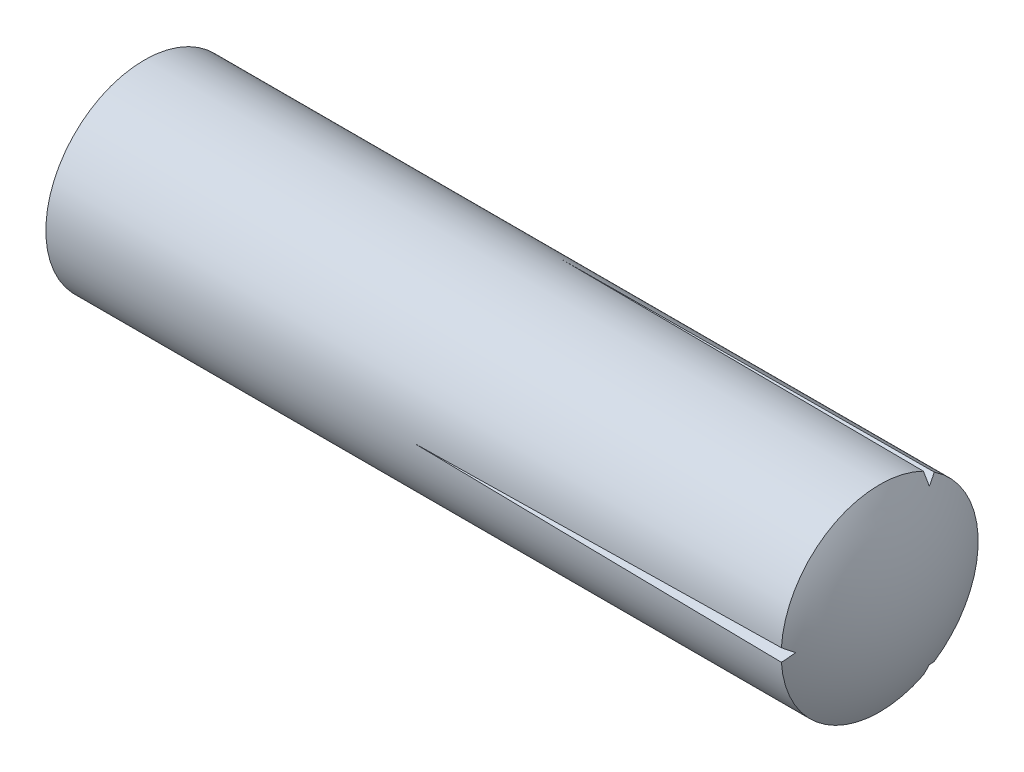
from build123d import *

# Parameters (mm, degrees)
CIRPATTERN1_COUNT = 3


with BuildPart() as part:
    # Sketch1 → Base-Revolve (revolve)
    with BuildSketch(Plane.XY):
        with BuildLine():
            Line((-100, 0), (-100, 1.25))
            ThreePointArc((-100, 1.25), (-99.010050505, 7.072345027), (-96.68190465, 12.5))
            Line((-96.68190465, 12.5), (-3.349364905, 12.5))
            ThreePointArc((-3.349364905, 12.5), (-0.851854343, 6.470476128), (0, 0))
            Line((0, 0), (-100, 0))
        make_face()
    revolve(axis=Axis((-40, 0, 0), (1, 0, 0)))

    # Cut-Sweep1: sweep along a path in Sketch4
    with BuildLine(Plane(origin=(0, 0, 0), x_dir=(1, 0, 0), z_dir=(0, 1, 0))) as cut_sweep1_path:
        Line((0, -11.25), (-50, -12.5))
    # Sketch2 → Cut-Sweep1 (sweep, cut)
    with BuildSketch(Plane(origin=(0, 0, 0), x_dir=(0, 0, -1), z_dir=(1, 0, 0))):
        Polygon((-11.25, 0), (-12.5, 0.875259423), (-12.5, -0.875259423), align=None)
    cut_sweep1 = sweep(path=cut_sweep1_path.line, mode=Mode.SUBTRACT)

    # CirPattern1: Cut-Sweep1 ×3 about axis
    cirpattern1_axis = Axis((0, 0, 0), (1, 0, 0))
    for i in range(1, CIRPATTERN1_COUNT):
        add(cut_sweep1.rotate(cirpattern1_axis, i * 360 / CIRPATTERN1_COUNT), mode=Mode.SUBTRACT)


solid = part.part
